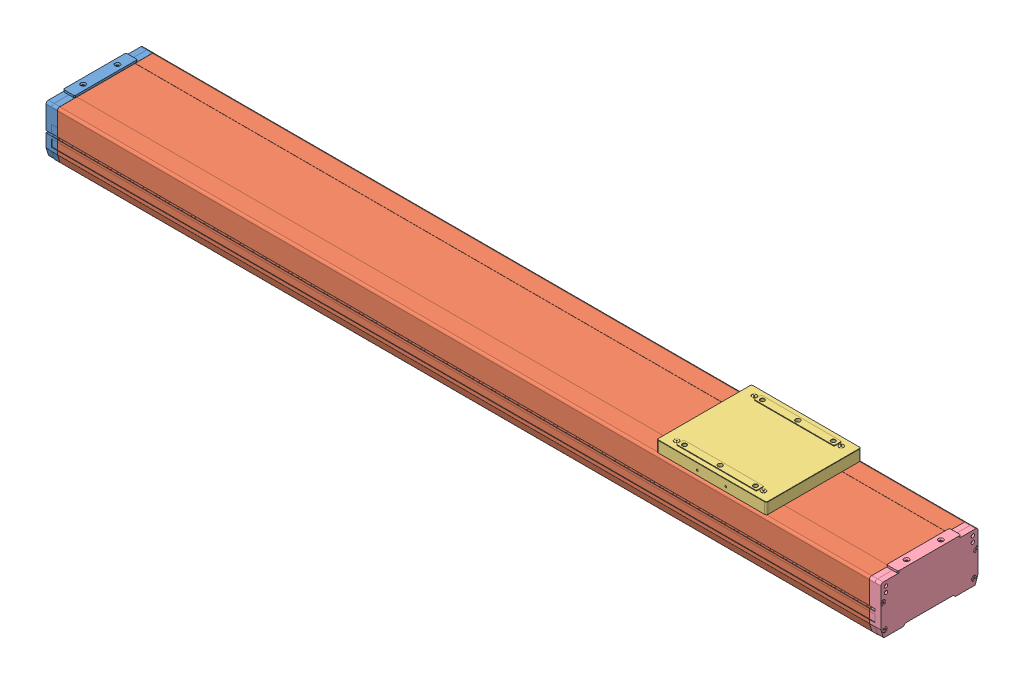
SolidWorks assembly TCD170-P-Z1FL-0.SLDASM, configuration 1050 (file format 9000). Lengths in mm.
Overall size (1461.26 107 183.43).
7 component instances, 5 part files, 20 mates.
Components (placement in the parent):
- TCD170-P-Z1FL-3-1: TCD170-P-Z1FL-3.sldprt [默认] at (262 0 0)
- TCD170-P-Z1FL-4-1: TCD170-P-Z1FL-4.SLDPRT [1050] at (-73.5 4 0) x (0 0 1) z (-1 0 0) size (170 85.3 1421)
- TCD170-P-Z1FL-2-1: TCD170-P-Z1FL-2.sldprt [默认] at (1069.1613 48 0) x (0 0 1) z (-1 0 0)
- TCD170-P-Z1FL-1-1: TCD170-P-Z1FL-1.sldprt [默认] at (1012 0 0)
- TCD170-P-Z1FL-5-1: TCD170-P-Z1FL-5.sldprt [默认] at (31.2004 6.5996 -28.5) x (0 0 -1) z (1 0 0)
- TCD170-P-Z1FL-5-2: TCD170-P-Z1FL-5.sldprt [默认] at (1101.8004 6.5996 -28.5) x (0 0 -1) z (1 0 0)
- TCD170-P-Z1FL-5-3: TCD170-P-Z1FL-5.sldprt [默认] at (61.2004 6.5996 -28.5) x (0 0 -1) z (1 0 0)
Mates (geometry in assembly coordinates):
- 重合1: coincident anti-aligned: plane of TCD170-P-Z1FL-3-1 through (-73.5 42.85 0) normal (1 0 0); plane of TCD170-P-Z1FL-4-1 through (-73.5 81.3 -81) normal (-1 0 0)
- 重合3: coincident aligned: plane of TCD170-P-Z1FL-3-1 through (-78.5 17.8311 85) normal (0 0 1); plane of TCD170-P-Z1FL-4-1 through (1347.5 14.8623 85) normal (0 0 1)
- 重合4: coincident aligned: plane of TCD170-P-Z1FL-1-1 through (1357.5 48.1811 85) normal (0 0 1); plane of TCD170-P-Z1FL-4-1 through (1347.5 14.8623 85) normal (0 0 1)
- 重合5: coincident aligned: plane of TCD170-P-Z1FL-1-1 through (1352.5 0 62.6896) normal (0 -1 0); plane of TCD170-P-Z1FL-4-1 through (1347.5 0 46) normal (0 -1 0)
- 重合6: coincident anti-aligned: plane of TCD170-P-Z1FL-1-1 through (1347.5 42.65 0) normal (-1 0 0); plane of TCD170-P-Z1FL-4-1 through (1347.5 81.3 -81) normal (1 0 0)
- 距离1: distance = 2 mm aligned: plane of TCD170-P-Z1FL-2-1 through (1069.1613 96 83) normal (0 0 1); plane of TCD170-P-Z1FL-4-1 through (1347.5 41.9 85) normal (0 0 1)
- 距离2: distance = 107 mm anti-aligned: plane of TCD170-P-Z1FL-2-1 through (1069.1613 107 68) normal (0 1 0); plane of TCD170-P-Z1FL-4-1 through (1347.5 0 46) normal (0 -1 0)
- 重合7: coincident aligned: plane of TCD170-P-Z1FL-3-1 through (-78.5 0 62.6896) normal (0 -1 0); plane of TCD170-P-Z1FL-4-1 through (1347.5 0 46) normal (0 -1 0)
- LimitDistance1: limit distance = 1066.6613 mm aligned: plane of TCD170-P-Z1FL-2-1 through (973.1613 96 0) normal (-1 0 0); plane of TCD170-P-Z1FL-3-1 through (-93.5 43 0) normal (-1 0 0)
- LimitDistance2: limit distance = 202.3387 mm aligned: plane of TCD170-P-Z1FL-2-1 through (1165.1613 96 0) normal (1 0 0); plane of TCD170-P-Z1FL-1-1 through (1367.5 44.75 0) normal (1 0 0)
- LimitDistance3: limit distance = 1272.5 mm aligned: plane of TCD170-P-Z1FL-2-1 through (1213.8477 96 0) normal (-1 0 0); plane of TCD170-P-Z1FL-3-1 through (-93.5 43 0) normal (-1 0 0)
- 重合8: coincident anti-aligned: plane of TCD170-P-Z1FL-4-1 through (1347.5 37.7 -85) normal (0 0 -1); plane of TCD170-P-Z1FL-5-1 through (187.7 28.8 -85) normal (0 0 1)
- 重合9: coincident aligned: plane of TCD170-P-Z1FL-4-1 through (1347.5 38 -83.3) normal (0 1 0); plane of TCD170-P-Z1FL-5-1 through (164.1 38 -85) normal (0 1 0)
- 重合10: coincident anti-aligned: plane of TCD170-P-Z1FL-4-1 through (1347.5 37.7 -85) normal (0 0 -1); plane of TCD170-P-Z1FL-5-2 through (1258.3 28.8 -85) normal (0 0 1)
- 重合11: coincident aligned: plane of TCD170-P-Z1FL-4-1 through (1347.5 38 -83.3) normal (0 1 0); plane of TCD170-P-Z1FL-5-2 through (1234.7 38 -85) normal (0 1 0)
- 重合12: coincident anti-aligned: plane of TCD170-P-Z1FL-4-1 through (1347.5 37.7 -85) normal (0 0 -1); plane of TCD170-P-Z1FL-5-3 through (217.7 28.8 -85) normal (0 0 1)
- 重合13: coincident aligned: plane of TCD170-P-Z1FL-4-1 through (1347.5 38 -83.3) normal (0 1 0); plane of TCD170-P-Z1FL-5-3 through (194.1 38 -85) normal (0 1 0)
- 距离3: distance = 30 mm aligned: plane of TCD170-P-Z1FL-5-3 through (201.5 28.8 -85) normal (-1 0 0); plane of TCD170-P-Z1FL-5-1 through (171.5 28.8 -85) normal (-1 0 0)
- 距离4: distance = 265 mm aligned: plane of TCD170-P-Z1FL-5-1 through (171.5 28.8 -85) normal (-1 0 0); plane of TCD170-P-Z1FL-3-1 through (-93.5 43 0) normal (-1 0 0)
- 距离5: distance = 119 mm aligned: plane of TCD170-P-Z1FL-5-2 through (1248.5 28.8 -85) normal (1 0 0); plane of TCD170-P-Z1FL-1-1 through (1367.5 44.75 0) normal (1 0 0)
